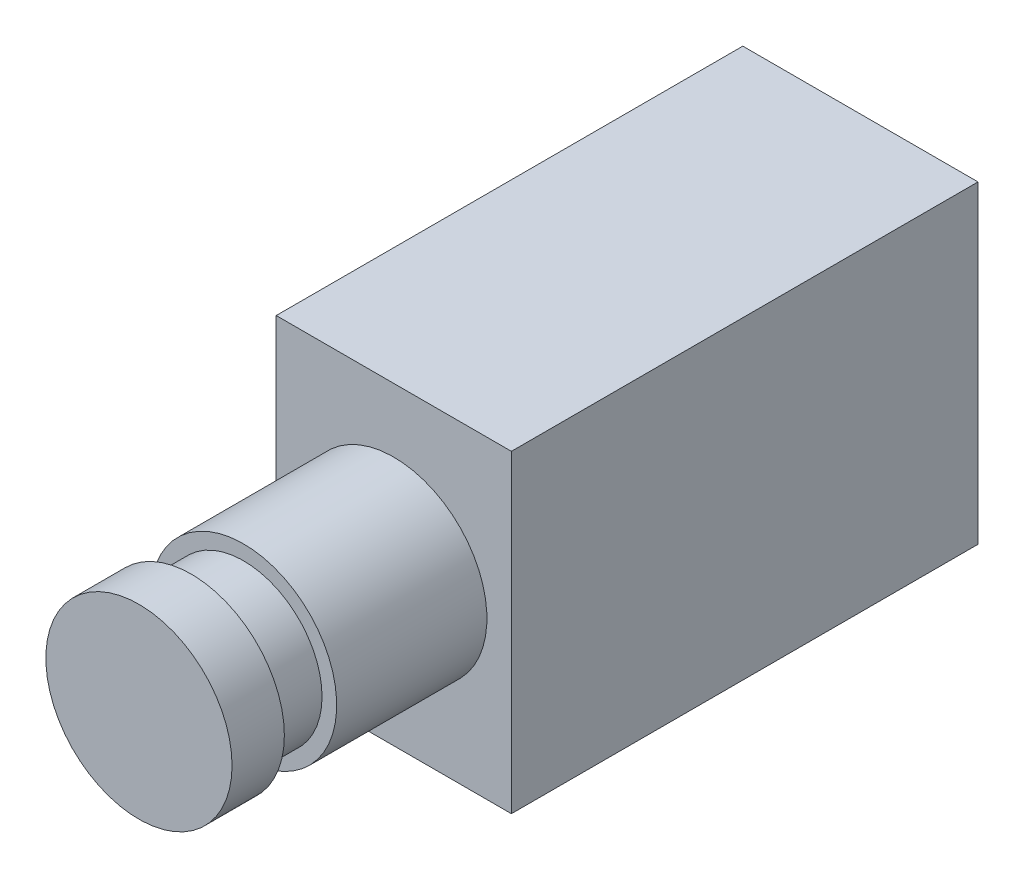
ISO-10303-21;
HEADER;
FILE_DESCRIPTION(('STEP AP214'),'2;1');
FILE_NAME('part.step','',(''),(''),'','','');
FILE_SCHEMA(('AUTOMOTIVE_DESIGN { 1 0 10303 214 1 1 1 1 }'));
ENDSEC;
DATA;
#1=APPLICATION_CONTEXT('core data for automotive mechanical design processes');
#2=APPLICATION_PROTOCOL_DEFINITION('international standard','automotive_design',2000,#1);
#3=PRODUCT_CONTEXT('',#1,'mechanical');
#4=PRODUCT('Part','Part','',(#3));
#5=PRODUCT_RELATED_PRODUCT_CATEGORY('part','',(#4));
#6=PRODUCT_DEFINITION_FORMATION('','',#4);
#7=PRODUCT_DEFINITION_CONTEXT('part definition',#1,'design');
#8=PRODUCT_DEFINITION('design','',#6,#7);
#9=PRODUCT_DEFINITION_SHAPE('','',#8);
#10=(LENGTH_UNIT() NAMED_UNIT(*) SI_UNIT(.MILLI.,.METRE.));
#11=(NAMED_UNIT(*) PLANE_ANGLE_UNIT() SI_UNIT($,.RADIAN.));
#12=(NAMED_UNIT(*) SI_UNIT($,.STERADIAN.) SOLID_ANGLE_UNIT());
#13=UNCERTAINTY_MEASURE_WITH_UNIT(LENGTH_MEASURE(1.E-05),#10,'distance_accuracy_value','');
#14=(GEOMETRIC_REPRESENTATION_CONTEXT(3) GLOBAL_UNCERTAINTY_ASSIGNED_CONTEXT((#13)) GLOBAL_UNIT_ASSIGNED_CONTEXT((#10,
#11,#12)) REPRESENTATION_CONTEXT('',''));
#15=CARTESIAN_POINT('',(0.,0.,0.));
#16=DIRECTION('',(0.,0.,1.));
#17=DIRECTION('',(1.,0.,0.));
#18=AXIS2_PLACEMENT_3D('',#15,#16,#17);
#19=CARTESIAN_POINT('',(7.1374,-9.525,28.321));
#20=DIRECTION('',(-1.,0.,0.));
#21=DIRECTION('',(0.,0.,1.));
#22=AXIS2_PLACEMENT_3D('',#19,#20,#21);
#23=PLANE('',#22);
#24=DIRECTION('',(0.,1.,0.));
#25=VECTOR('',#24,1.);
#26=CARTESIAN_POINT('',(7.1374,-9.525,0.));
#27=LINE('',#26,#25);
#28=CARTESIAN_POINT('',(7.1374,-9.525,0.));
#29=VERTEX_POINT('',#28);
#30=CARTESIAN_POINT('',(7.1374,9.525,0.));
#31=VERTEX_POINT('',#30);
#32=EDGE_CURVE('E112',#29,#31,#27,.T.);
#33=ORIENTED_EDGE('',*,*,#32,.T.);
#34=DIRECTION('',(0.,0.,-1.));
#35=VECTOR('',#34,1.);
#36=CARTESIAN_POINT('',(7.1374,9.525,28.321));
#37=LINE('',#36,#35);
#38=CARTESIAN_POINT('',(7.1374,9.525,28.321));
#39=VERTEX_POINT('',#38);
#40=EDGE_CURVE('E48',#39,#31,#37,.T.);
#41=ORIENTED_EDGE('',*,*,#40,.F.);
#42=DIRECTION('',(0.,1.,0.));
#43=VECTOR('',#42,1.);
#44=CARTESIAN_POINT('',(7.1374,-9.525,28.321));
#45=LINE('',#44,#43);
#46=CARTESIAN_POINT('',(7.1374,-9.525,28.321));
#47=VERTEX_POINT('',#46);
#48=EDGE_CURVE('E99',#47,#39,#45,.T.);
#49=ORIENTED_EDGE('',*,*,#48,.F.);
#50=DIRECTION('',(0.,0.,-1.));
#51=VECTOR('',#50,1.);
#52=CARTESIAN_POINT('',(7.1374,-9.525,28.321));
#53=LINE('',#52,#51);
#54=EDGE_CURVE('E108',#47,#29,#53,.T.);
#55=ORIENTED_EDGE('',*,*,#54,.T.);
#56=EDGE_LOOP('',(#33,#41,#49,#55));
#57=FACE_BOUND('',#56,.T.);
#58=ADVANCED_FACE('F45',(#57),#23,.F.);
#59=CARTESIAN_POINT('',(-7.1374,9.525,28.321));
#60=DIRECTION('',(0.,-1.,0.));
#61=DIRECTION('',(0.,0.,-1.));
#62=AXIS2_PLACEMENT_3D('',#59,#60,#61);
#63=PLANE('',#62);
#64=DIRECTION('',(-1.,0.,0.));
#65=VECTOR('',#64,1.);
#66=CARTESIAN_POINT('',(-7.1374,9.525,0.));
#67=LINE('',#66,#65);
#68=CARTESIAN_POINT('',(-7.1374,9.525,0.));
#69=VERTEX_POINT('',#68);
#70=EDGE_CURVE('E104',#31,#69,#67,.T.);
#71=ORIENTED_EDGE('',*,*,#70,.T.);
#72=DIRECTION('',(0.,0.,-1.));
#73=VECTOR('',#72,1.);
#74=CARTESIAN_POINT('',(-7.1374,9.525,28.321));
#75=LINE('',#74,#73);
#76=CARTESIAN_POINT('',(-7.1374,9.525,28.321));
#77=VERTEX_POINT('',#76);
#78=EDGE_CURVE('E102',#77,#69,#75,.T.);
#79=ORIENTED_EDGE('',*,*,#78,.F.);
#80=DIRECTION('',(-1.,0.,0.));
#81=VECTOR('',#80,1.);
#82=CARTESIAN_POINT('',(-7.1374,9.525,28.321));
#83=LINE('',#82,#81);
#84=EDGE_CURVE('E94',#39,#77,#83,.T.);
#85=ORIENTED_EDGE('',*,*,#84,.F.);
#86=ORIENTED_EDGE('',*,*,#40,.T.);
#87=EDGE_LOOP('',(#71,#79,#85,#86));
#88=FACE_BOUND('',#87,.T.);
#89=ADVANCED_FACE('F103',(#88),#63,.F.);
#90=CARTESIAN_POINT('',(-7.1374,-9.525,28.321));
#91=DIRECTION('',(1.,0.,0.));
#92=DIRECTION('',(0.,0.,-1.));
#93=AXIS2_PLACEMENT_3D('',#90,#91,#92);
#94=PLANE('',#93);
#95=DIRECTION('',(0.,-1.,0.));
#96=VECTOR('',#95,1.);
#97=CARTESIAN_POINT('',(-7.1374,-9.525,0.));
#98=LINE('',#97,#96);
#99=CARTESIAN_POINT('',(-7.1374,-9.525,0.));
#100=VERTEX_POINT('',#99);
#101=EDGE_CURVE('E80',#69,#100,#98,.T.);
#102=ORIENTED_EDGE('',*,*,#101,.T.);
#103=DIRECTION('',(0.,0.,-1.));
#104=VECTOR('',#103,1.);
#105=CARTESIAN_POINT('',(-7.1374,-9.525,28.321));
#106=LINE('',#105,#104);
#107=CARTESIAN_POINT('',(-7.1374,-9.525,28.321));
#108=VERTEX_POINT('',#107);
#109=EDGE_CURVE('E105',#108,#100,#106,.T.);
#110=ORIENTED_EDGE('',*,*,#109,.F.);
#111=DIRECTION('',(0.,-1.,0.));
#112=VECTOR('',#111,1.);
#113=CARTESIAN_POINT('',(-7.1374,-9.525,28.321));
#114=LINE('',#113,#112);
#115=EDGE_CURVE('E97',#77,#108,#114,.T.);
#116=ORIENTED_EDGE('',*,*,#115,.F.);
#117=ORIENTED_EDGE('',*,*,#78,.T.);
#118=EDGE_LOOP('',(#102,#110,#116,#117));
#119=FACE_BOUND('',#118,.T.);
#120=ADVANCED_FACE('F106',(#119),#94,.F.);
#121=CARTESIAN_POINT('',(-7.1374,-9.525,28.321));
#122=DIRECTION('',(0.,1.,0.));
#123=DIRECTION('',(0.,0.,1.));
#124=AXIS2_PLACEMENT_3D('',#121,#122,#123);
#125=PLANE('',#124);
#126=DIRECTION('',(1.,0.,0.));
#127=VECTOR('',#126,1.);
#128=CARTESIAN_POINT('',(-7.1374,-9.525,0.));
#129=LINE('',#128,#127);
#130=EDGE_CURVE('E86',#100,#29,#129,.T.);
#131=ORIENTED_EDGE('',*,*,#130,.T.);
#132=ORIENTED_EDGE('',*,*,#54,.F.);
#133=DIRECTION('',(1.,0.,0.));
#134=VECTOR('',#133,1.);
#135=CARTESIAN_POINT('',(-7.1374,-9.525,28.321));
#136=LINE('',#135,#134);
#137=EDGE_CURVE('E63',#108,#47,#136,.T.);
#138=ORIENTED_EDGE('',*,*,#137,.F.);
#139=ORIENTED_EDGE('',*,*,#109,.T.);
#140=EDGE_LOOP('',(#131,#132,#138,#139));
#141=FACE_BOUND('',#140,.T.);
#142=ADVANCED_FACE('F120',(#141),#125,.F.);
#143=CARTESIAN_POINT('',(0.,0.,28.321));
#144=DIRECTION('',(0.,0.,-1.));
#145=DIRECTION('',(-1.,0.,0.));
#146=AXIS2_PLACEMENT_3D('',#143,#144,#145);
#147=PLANE('',#146);
#148=CARTESIAN_POINT('',(0.,0.,28.321));
#149=DIRECTION('',(0.,0.,1.));
#150=DIRECTION('',(1.,0.,0.));
#151=AXIS2_PLACEMENT_3D('',#148,#149,#150);
#152=CIRCLE('',#151,5.6515);
#153=CARTESIAN_POINT('',(-5.6515,0.,28.321));
#154=VERTEX_POINT('',#153);
#155=EDGE_CURVE('E54',#154,#154,#152,.T.);
#156=ORIENTED_EDGE('',*,*,#155,.F.);
#157=EDGE_LOOP('',(#156));
#158=FACE_BOUND('',#157,.T.);
#159=ORIENTED_EDGE('',*,*,#48,.T.);
#160=ORIENTED_EDGE('',*,*,#84,.T.);
#161=ORIENTED_EDGE('',*,*,#115,.T.);
#162=ORIENTED_EDGE('',*,*,#137,.T.);
#163=EDGE_LOOP('',(#159,#160,#161,#162));
#164=FACE_BOUND('',#163,.T.);
#165=ADVANCED_FACE('F95',(#158,#164),#147,.F.);
#166=CARTESIAN_POINT('',(0.,0.,0.));
#167=DIRECTION('',(0.,0.,-1.));
#168=DIRECTION('',(-1.,0.,0.));
#169=AXIS2_PLACEMENT_3D('',#166,#167,#168);
#170=PLANE('',#169);
#171=ORIENTED_EDGE('',*,*,#32,.F.);
#172=ORIENTED_EDGE('',*,*,#130,.F.);
#173=ORIENTED_EDGE('',*,*,#101,.F.);
#174=ORIENTED_EDGE('',*,*,#70,.F.);
#175=EDGE_LOOP('',(#171,#172,#173,#174));
#176=FACE_BOUND('',#175,.T.);
#177=ADVANCED_FACE('F123',(#176),#170,.T.);
#178=CARTESIAN_POINT('',(0.,0.,37.4396));
#179=DIRECTION('',(0.,0.,-1.));
#180=DIRECTION('',(-1.,0.,0.));
#181=AXIS2_PLACEMENT_3D('',#178,#179,#180);
#182=CYLINDRICAL_SURFACE('',#181,5.6515);
#183=CARTESIAN_POINT('',(0.,0.,37.4396));
#184=DIRECTION('',(0.,0.,1.));
#185=DIRECTION('',(1.,0.,0.));
#186=AXIS2_PLACEMENT_3D('',#183,#184,#185);
#187=CIRCLE('',#186,5.6515);
#188=CARTESIAN_POINT('',(-5.6515,0.,37.4396));
#189=VERTEX_POINT('',#188);
#190=EDGE_CURVE('E115',#189,#189,#187,.T.);
#191=CARTESIAN_POINT('',(-5.6515,0.,37.4396));
#192=CARTESIAN_POINT('',(-5.6515,0.,37.3446145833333));
#193=CARTESIAN_POINT('',(-5.6515,0.,37.2496291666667));
#194=CARTESIAN_POINT('',(-5.6515,0.,37.0596583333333));
#195=CARTESIAN_POINT('',(-5.6515,0.,36.9646729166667));
#196=CARTESIAN_POINT('',(-5.6515,0.,36.7747020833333));
#197=CARTESIAN_POINT('',(-5.6515,0.,36.6797166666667));
#198=CARTESIAN_POINT('',(-5.6515,0.,36.4897458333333));
#199=CARTESIAN_POINT('',(-5.6515,0.,36.3947604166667));
#200=CARTESIAN_POINT('',(-5.6515,0.,36.2047895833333));
#201=CARTESIAN_POINT('',(-5.6515,0.,36.1098041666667));
#202=CARTESIAN_POINT('',(-5.6515,0.,35.9198333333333));
#203=CARTESIAN_POINT('',(-5.6515,0.,35.8248479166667));
#204=CARTESIAN_POINT('',(-5.6515,0.,35.6348770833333));
#205=CARTESIAN_POINT('',(-5.6515,0.,35.5398916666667));
#206=CARTESIAN_POINT('',(-5.6515,0.,35.3499208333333));
#207=CARTESIAN_POINT('',(-5.6515,0.,35.2549354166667));
#208=CARTESIAN_POINT('',(-5.6515,0.,35.0649645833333));
#209=CARTESIAN_POINT('',(-5.6515,0.,34.9699791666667));
#210=CARTESIAN_POINT('',(-5.6515,0.,34.7800083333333));
#211=CARTESIAN_POINT('',(-5.6515,0.,34.6850229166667));
#212=CARTESIAN_POINT('',(-5.6515,0.,34.4950520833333));
#213=CARTESIAN_POINT('',(-5.6515,0.,34.4000666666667));
#214=CARTESIAN_POINT('',(-5.6515,0.,34.2100958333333));
#215=CARTESIAN_POINT('',(-5.6515,0.,34.1151104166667));
#216=CARTESIAN_POINT('',(-5.6515,0.,33.9251395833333));
#217=CARTESIAN_POINT('',(-5.6515,0.,33.8301541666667));
#218=CARTESIAN_POINT('',(-5.6515,0.,33.6401833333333));
#219=CARTESIAN_POINT('',(-5.6515,0.,33.5451979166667));
#220=CARTESIAN_POINT('',(-5.6515,0.,33.3552270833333));
#221=CARTESIAN_POINT('',(-5.6515,0.,33.2602416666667));
#222=CARTESIAN_POINT('',(-5.6515,0.,33.0702708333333));
#223=CARTESIAN_POINT('',(-5.6515,0.,32.9752854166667));
#224=CARTESIAN_POINT('',(-5.6515,0.,32.7853145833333));
#225=CARTESIAN_POINT('',(-5.6515,0.,32.6903291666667));
#226=CARTESIAN_POINT('',(-5.6515,0.,32.5003583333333));
#227=CARTESIAN_POINT('',(-5.6515,0.,32.4053729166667));
#228=CARTESIAN_POINT('',(-5.6515,0.,32.2154020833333));
#229=CARTESIAN_POINT('',(-5.6515,0.,32.1204166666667));
#230=CARTESIAN_POINT('',(-5.6515,0.,31.9304458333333));
#231=CARTESIAN_POINT('',(-5.6515,0.,31.8354604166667));
#232=CARTESIAN_POINT('',(-5.6515,0.,31.6454895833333));
#233=CARTESIAN_POINT('',(-5.6515,0.,31.5505041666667));
#234=CARTESIAN_POINT('',(-5.6515,0.,31.3605333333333));
#235=CARTESIAN_POINT('',(-5.6515,0.,31.2655479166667));
#236=CARTESIAN_POINT('',(-5.6515,0.,31.0755770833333));
#237=CARTESIAN_POINT('',(-5.6515,0.,30.9805916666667));
#238=CARTESIAN_POINT('',(-5.6515,0.,30.7906208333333));
#239=CARTESIAN_POINT('',(-5.6515,0.,30.6956354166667));
#240=CARTESIAN_POINT('',(-5.6515,0.,30.5056645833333));
#241=CARTESIAN_POINT('',(-5.6515,0.,30.4106791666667));
#242=CARTESIAN_POINT('',(-5.6515,0.,30.2207083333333));
#243=CARTESIAN_POINT('',(-5.6515,0.,30.1257229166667));
#244=CARTESIAN_POINT('',(-5.6515,0.,29.9357520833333));
#245=CARTESIAN_POINT('',(-5.6515,0.,29.8407666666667));
#246=CARTESIAN_POINT('',(-5.6515,0.,29.6507958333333));
#247=CARTESIAN_POINT('',(-5.6515,0.,29.5558104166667));
#248=CARTESIAN_POINT('',(-5.6515,0.,29.3658395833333));
#249=CARTESIAN_POINT('',(-5.6515,0.,29.2708541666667));
#250=CARTESIAN_POINT('',(-5.6515,0.,29.0808833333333));
#251=CARTESIAN_POINT('',(-5.6515,0.,28.9858979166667));
#252=CARTESIAN_POINT('',(-5.6515,0.,28.7959270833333));
#253=CARTESIAN_POINT('',(-5.6515,0.,28.7009416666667));
#254=CARTESIAN_POINT('',(-5.6515,0.,28.5109708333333));
#255=CARTESIAN_POINT('',(-5.6515,0.,28.4159854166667));
#256=CARTESIAN_POINT('',(-5.6515,0.,28.321));
#257=B_SPLINE_CURVE_WITH_KNOTS('',3,(#191,#192,#193,#194,#195,#196,#197,#198,#199,#200,#201,
#202,#203,#204,#205,#206,#207,#208,#209,#210,#211,#212,#213,#214,#215,#216,#217,#218,#219,#220,
#221,#222,#223,#224,#225,#226,#227,#228,#229,#230,#231,#232,#233,#234,#235,#236,#237,#238,#239,
#240,#241,#242,#243,#244,#245,#246,#247,#248,#249,#250,#251,#252,#253,#254,#255,#256),
.UNSPECIFIED.,.F.,.F.,(4,2,2,2,2,2,2,2,2,2,2,2,2,2,2,2,2,2,2,2,2,2,2,2,2,2,2,2,2,2,2,2,4),(0.,
0.284956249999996,0.569912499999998,0.854868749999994,1.139825,1.42478124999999,1.7097375,
1.99469375,2.27964999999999,2.56460625,2.84956249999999,3.13451875,3.419475,3.70443124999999,
3.9893875,4.27434374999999,4.5593,4.84425625,5.12921249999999,5.41416875,5.69912499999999,
5.98408125,6.26903749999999,6.55399374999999,6.83894999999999,7.12390624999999,7.4088625,
7.69381874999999,7.97877499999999,8.26373124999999,8.54868749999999,8.83364374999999,
9.11859999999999),.UNSPECIFIED.);
#258=EDGE_CURVE('BSEAM172',#189,#154,#257,.T.);
#259=ORIENTED_EDGE('',*,*,#190,.F.);
#260=ORIENTED_EDGE('',*,*,#155,.T.);
#261=ORIENTED_EDGE('',*,*,#258,.T.);
#262=ORIENTED_EDGE('',*,*,#258,.F.);
#263=EDGE_LOOP('',(#259,#261,#260,#262));
#264=FACE_BOUND('',#263,.T.);
#265=ADVANCED_FACE('F172',(#264),#182,.T.);
#266=CARTESIAN_POINT('',(0.,0.,37.4396));
#267=DIRECTION('',(0.,0.,1.));
#268=DIRECTION('',(1.,0.,0.));
#269=AXIS2_PLACEMENT_3D('',#266,#267,#268);
#270=PLANE('',#269);
#271=CARTESIAN_POINT('',(0.,0.,37.4396));
#272=DIRECTION('',(0.,0.,1.));
#273=DIRECTION('',(1.,0.,0.));
#274=AXIS2_PLACEMENT_3D('',#271,#272,#273);
#275=CIRCLE('',#274,4.7625);
#276=CARTESIAN_POINT('',(4.7625,0.,37.4396));
#277=VERTEX_POINT('',#276);
#278=EDGE_CURVE('E11',#277,#277,#275,.T.);
#279=ORIENTED_EDGE('',*,*,#278,.F.);
#280=EDGE_LOOP('',(#279));
#281=FACE_BOUND('',#280,.T.);
#282=ORIENTED_EDGE('',*,*,#190,.T.);
#283=EDGE_LOOP('',(#282));
#284=FACE_BOUND('',#283,.T.);
#285=ADVANCED_FACE('F178',(#281,#284),#270,.T.);
#286=CARTESIAN_POINT('',(0.,0.,40.6146));
#287=DIRECTION('',(0.,0.,-1.));
#288=DIRECTION('',(-1.,0.,0.));
#289=AXIS2_PLACEMENT_3D('',#286,#287,#288);
#290=CYLINDRICAL_SURFACE('',#289,4.7625);
#291=CARTESIAN_POINT('',(0.,0.,40.6146));
#292=DIRECTION('',(0.,0.,1.));
#293=DIRECTION('',(1.,0.,0.));
#294=AXIS2_PLACEMENT_3D('',#291,#292,#293);
#295=CIRCLE('',#294,4.7625);
#296=CARTESIAN_POINT('',(4.7625,0.,40.6146));
#297=VERTEX_POINT('',#296);
#298=EDGE_CURVE('E129',#297,#297,#295,.T.);
#299=ORIENTED_EDGE('',*,*,#298,.F.);
#300=EDGE_LOOP('',(#299));
#301=FACE_BOUND('',#300,.T.);
#302=ORIENTED_EDGE('',*,*,#278,.T.);
#303=EDGE_LOOP('',(#302));
#304=FACE_BOUND('',#303,.T.);
#305=ADVANCED_FACE('F145',(#301,#304),#290,.T.);
#306=CARTESIAN_POINT('',(0.,0.,43.7896));
#307=DIRECTION('',(0.,0.,-1.));
#308=DIRECTION('',(-1.,0.,0.));
#309=AXIS2_PLACEMENT_3D('',#306,#307,#308);
#310=CYLINDRICAL_SURFACE('',#309,5.6515);
#311=CARTESIAN_POINT('',(0.,0.,43.7896));
#312=DIRECTION('',(0.,0.,1.));
#313=DIRECTION('',(1.,0.,0.));
#314=AXIS2_PLACEMENT_3D('',#311,#312,#313);
#315=CIRCLE('',#314,5.6515);
#316=CARTESIAN_POINT('',(5.6515,0.,43.7896));
#317=VERTEX_POINT('',#316);
#318=EDGE_CURVE('E133',#317,#317,#315,.T.);
#319=ORIENTED_EDGE('',*,*,#318,.F.);
#320=EDGE_LOOP('',(#319));
#321=FACE_BOUND('',#320,.T.);
#322=CARTESIAN_POINT('',(0.,0.,40.6146));
#323=DIRECTION('',(0.,0.,1.));
#324=DIRECTION('',(1.,0.,0.));
#325=AXIS2_PLACEMENT_3D('',#322,#323,#324);
#326=CIRCLE('',#325,5.6515);
#327=CARTESIAN_POINT('',(5.6515,0.,40.6146));
#328=VERTEX_POINT('',#327);
#329=EDGE_CURVE('E134',#328,#328,#326,.T.);
#330=ORIENTED_EDGE('',*,*,#329,.T.);
#331=EDGE_LOOP('',(#330));
#332=FACE_BOUND('',#331,.T.);
#333=ADVANCED_FACE('F142',(#321,#332),#310,.T.);
#334=CARTESIAN_POINT('',(0.,0.,43.7896));
#335=DIRECTION('',(0.,0.,1.));
#336=DIRECTION('',(1.,0.,0.));
#337=AXIS2_PLACEMENT_3D('',#334,#335,#336);
#338=PLANE('',#337);
#339=ORIENTED_EDGE('',*,*,#318,.T.);
#340=EDGE_LOOP('',(#339));
#341=FACE_BOUND('',#340,.T.);
#342=ADVANCED_FACE('F140',(#341),#338,.T.);
#343=CARTESIAN_POINT('',(0.,0.,40.6146));
#344=DIRECTION('',(0.,0.,1.));
#345=DIRECTION('',(1.,0.,0.));
#346=AXIS2_PLACEMENT_3D('',#343,#344,#345);
#347=PLANE('',#346);
#348=ORIENTED_EDGE('',*,*,#298,.T.);
#349=EDGE_LOOP('',(#348));
#350=FACE_BOUND('',#349,.T.);
#351=ORIENTED_EDGE('',*,*,#329,.F.);
#352=EDGE_LOOP('',(#351));
#353=FACE_BOUND('',#352,.T.);
#354=ADVANCED_FACE('F149',(#350,#353),#347,.F.);
#355=CLOSED_SHELL('',(#58,#89,#120,#142,#165,#177,#265,#285,#305,#333,#342,#354));
#356=MANIFOLD_SOLID_BREP('B2',#355);
#357=ADVANCED_BREP_SHAPE_REPRESENTATION('',(#18,#356),#14);
#358=SHAPE_DEFINITION_REPRESENTATION(#9,#357);
ENDSEC;
END-ISO-10303-21;
